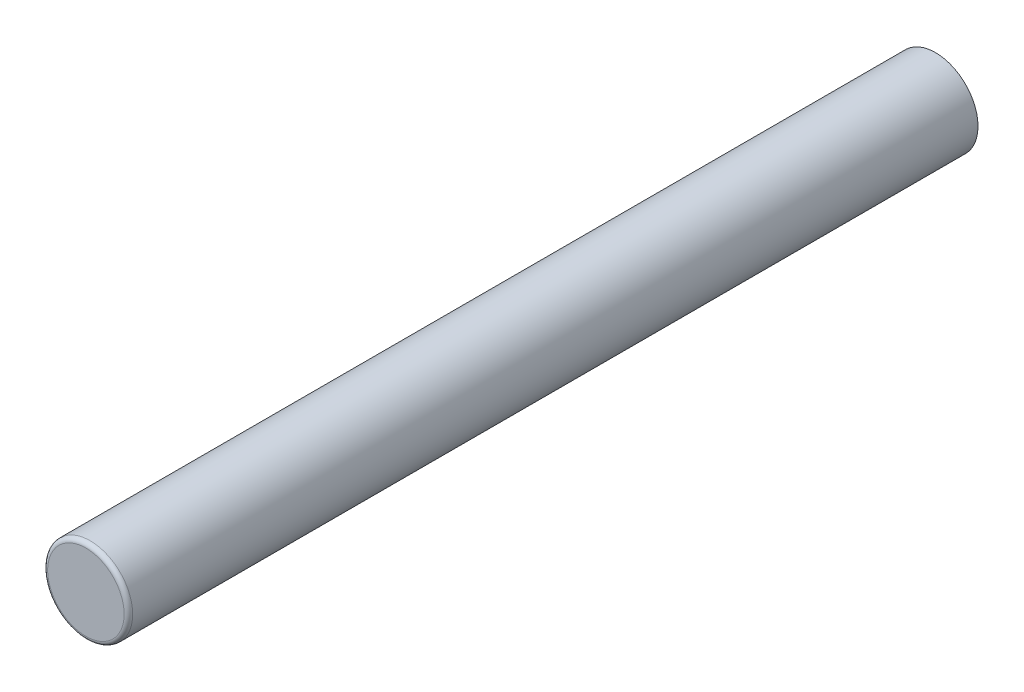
from build123d import *

# Parameters (mm, degrees)
SKETCH1_R           = 1
BOSS_EXTRUDE1_DEPTH = 10
FILLET1_R           = 0.1


with BuildPart() as part:
    # Sketch1 → Boss-Extrude1 (new, symmetric)
    with BuildSketch(Plane.XY):
        Circle(SKETCH1_R)
    extrude(amount=BOSS_EXTRUDE1_DEPTH, both=True)

    # Fillet1
    fillet1_edges = [part.edges().sort_by_distance(p)[0] for p in [
        (-1, 0, 10),
    ]]
    fillet(fillet1_edges, radius=FILLET1_R)


solid = part.part
